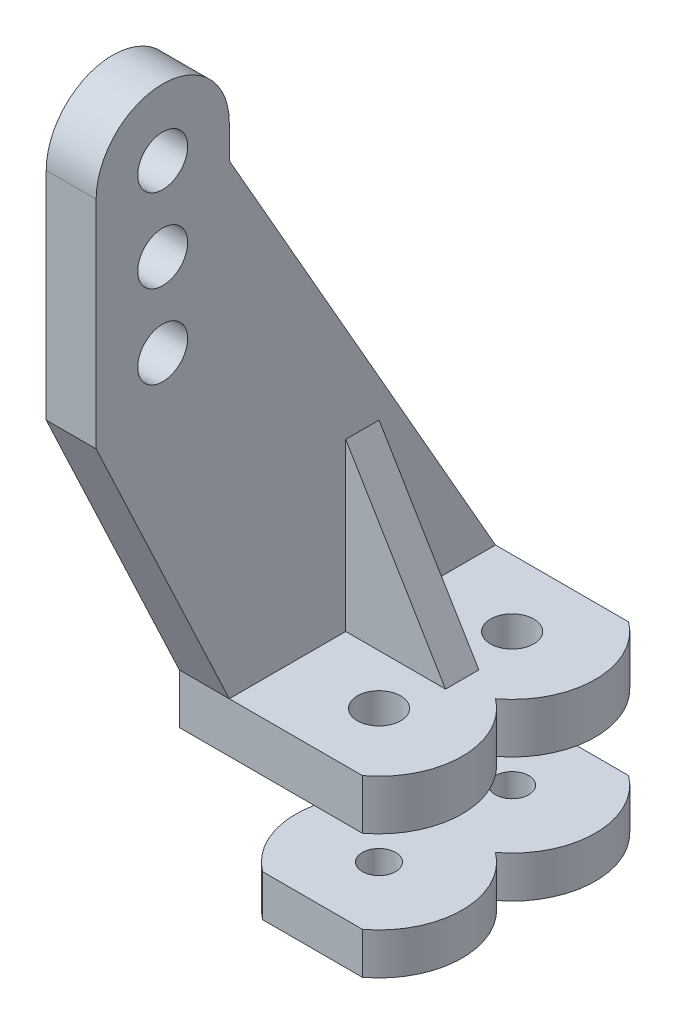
ISO-10303-21;
HEADER;
FILE_DESCRIPTION(('STEP AP214'),'2;1');
FILE_NAME('part.step','',(''),(''),'','','');
FILE_SCHEMA(('AUTOMOTIVE_DESIGN { 1 0 10303 214 1 1 1 1 }'));
ENDSEC;
DATA;
#1=APPLICATION_CONTEXT('core data for automotive mechanical design processes');
#2=APPLICATION_PROTOCOL_DEFINITION('international standard','automotive_design',2000,#1);
#3=PRODUCT_CONTEXT('',#1,'mechanical');
#4=PRODUCT('Part','Part','',(#3));
#5=PRODUCT_RELATED_PRODUCT_CATEGORY('part','',(#4));
#6=PRODUCT_DEFINITION_FORMATION('','',#4);
#7=PRODUCT_DEFINITION_CONTEXT('part definition',#1,'design');
#8=PRODUCT_DEFINITION('design','',#6,#7);
#9=PRODUCT_DEFINITION_SHAPE('','',#8);
#10=(LENGTH_UNIT() NAMED_UNIT(*) SI_UNIT(.MILLI.,.METRE.));
#11=(NAMED_UNIT(*) PLANE_ANGLE_UNIT() SI_UNIT($,.RADIAN.));
#12=(NAMED_UNIT(*) SI_UNIT($,.STERADIAN.) SOLID_ANGLE_UNIT());
#13=UNCERTAINTY_MEASURE_WITH_UNIT(LENGTH_MEASURE(1.E-05),#10,'distance_accuracy_value','');
#14=(GEOMETRIC_REPRESENTATION_CONTEXT(3) GLOBAL_UNCERTAINTY_ASSIGNED_CONTEXT((#13)) GLOBAL_UNIT_ASSIGNED_CONTEXT((#10,
#11,#12)) REPRESENTATION_CONTEXT('',''));
#15=CARTESIAN_POINT('',(0.,0.,0.));
#16=DIRECTION('',(0.,0.,1.));
#17=DIRECTION('',(1.,0.,0.));
#18=AXIS2_PLACEMENT_3D('',#15,#16,#17);
#19=CARTESIAN_POINT('',(6.5,-5.,-8.));
#20=DIRECTION('',(0.,1.,0.));
#21=DIRECTION('',(0.,0.,1.));
#22=AXIS2_PLACEMENT_3D('',#19,#20,#21);
#23=PLANE('',#22);
#24=CARTESIAN_POINT('',(6.5,-5.,-8.));
#25=DIRECTION('',(0.,1.,0.));
#26=DIRECTION('',(0.,0.,1.));
#27=AXIS2_PLACEMENT_3D('',#24,#25,#26);
#28=CIRCLE('',#27,2.);
#29=CARTESIAN_POINT('',(6.5,-5.,-6.));
#30=VERTEX_POINT('',#29);
#31=EDGE_CURVE('E48',#30,#30,#28,.F.);
#32=ORIENTED_EDGE('',*,*,#31,.F.);
#33=EDGE_LOOP('',(#32));
#34=FACE_BOUND('',#33,.T.);
#35=CARTESIAN_POINT('',(6.5,-5.,-8.));
#36=DIRECTION('',(0.,1.,0.));
#37=DIRECTION('',(0.,0.,1.));
#38=AXIS2_PLACEMENT_3D('',#35,#36,#37);
#39=CIRCLE('',#38,5.);
#40=CARTESIAN_POINT('',(3.5,-5.,-12.));
#41=VERTEX_POINT('',#40);
#42=CARTESIAN_POINT('',(3.5,-5.,-3.99999999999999));
#43=VERTEX_POINT('',#42);
#44=EDGE_CURVE('E97',#41,#43,#39,.T.);
#45=ORIENTED_EDGE('',*,*,#44,.F.);
#46=CARTESIAN_POINT('',(6.5,-5.,-16.));
#47=DIRECTION('',(0.,1.,0.));
#48=DIRECTION('',(0.,0.,1.));
#49=AXIS2_PLACEMENT_3D('',#46,#47,#48);
#50=CIRCLE('',#49,5.);
#51=CARTESIAN_POINT('',(3.5,-5.,-20.));
#52=VERTEX_POINT('',#51);
#53=EDGE_CURVE('E102',#52,#41,#50,.T.);
#54=ORIENTED_EDGE('',*,*,#53,.F.);
#55=DIRECTION('',(-1.,0.,0.));
#56=VECTOR('',#55,1.);
#57=CARTESIAN_POINT('',(9.49999999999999,-5.,-20.));
#58=LINE('',#57,#56);
#59=CARTESIAN_POINT('',(9.5,-5.,-20.));
#60=VERTEX_POINT('',#59);
#61=EDGE_CURVE('E138',#60,#52,#58,.T.);
#62=ORIENTED_EDGE('',*,*,#61,.F.);
#63=CARTESIAN_POINT('',(6.5,-5.,-16.));
#64=DIRECTION('',(0.,1.,0.));
#65=DIRECTION('',(0.,0.,1.));
#66=AXIS2_PLACEMENT_3D('',#63,#64,#65);
#67=CIRCLE('',#66,5.);
#68=CARTESIAN_POINT('',(9.5,-5.,-12.));
#69=VERTEX_POINT('',#68);
#70=EDGE_CURVE('E135',#69,#60,#67,.T.);
#71=ORIENTED_EDGE('',*,*,#70,.F.);
#72=CARTESIAN_POINT('',(6.5,-5.,-8.));
#73=DIRECTION('',(0.,1.,0.));
#74=DIRECTION('',(0.,0.,1.));
#75=AXIS2_PLACEMENT_3D('',#72,#73,#74);
#76=CIRCLE('',#75,5.);
#77=CARTESIAN_POINT('',(9.49999999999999,-5.,-3.99999999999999));
#78=VERTEX_POINT('',#77);
#79=EDGE_CURVE('E132',#78,#69,#76,.T.);
#80=ORIENTED_EDGE('',*,*,#79,.F.);
#81=DIRECTION('',(1.,0.,0.));
#82=VECTOR('',#81,1.);
#83=CARTESIAN_POINT('',(9.49999999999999,-5.,-3.99999999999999));
#84=LINE('',#83,#82);
#85=EDGE_CURVE('E130',#43,#78,#84,.T.);
#86=ORIENTED_EDGE('',*,*,#85,.F.);
#87=EDGE_LOOP('',(#45,#54,#62,#71,#80,#86));
#88=FACE_BOUND('',#87,.T.);
#89=CARTESIAN_POINT('',(6.5,-5.,-16.));
#90=DIRECTION('',(0.,1.,0.));
#91=DIRECTION('',(0.,0.,1.));
#92=AXIS2_PLACEMENT_3D('',#89,#90,#91);
#93=CIRCLE('',#92,2.);
#94=CARTESIAN_POINT('',(6.5,-5.,-14.));
#95=VERTEX_POINT('',#94);
#96=EDGE_CURVE('E12',#95,#95,#93,.F.);
#97=ORIENTED_EDGE('',*,*,#96,.F.);
#98=EDGE_LOOP('',(#97));
#99=FACE_BOUND('',#98,.T.);
#100=ADVANCED_FACE('F40',(#34,#88,#99),#23,.F.);
#101=CARTESIAN_POINT('',(6.5,-5.,-8.));
#102=DIRECTION('',(0.,1.,0.));
#103=DIRECTION('',(0.,0.,1.));
#104=AXIS2_PLACEMENT_3D('',#101,#102,#103);
#105=CYLINDRICAL_SURFACE('',#104,5.);
#106=CARTESIAN_POINT('',(6.5,-2.5,-8.));
#107=DIRECTION('',(0.,1.,0.));
#108=DIRECTION('',(0.,0.,1.));
#109=AXIS2_PLACEMENT_3D('',#106,#107,#108);
#110=CIRCLE('',#109,5.);
#111=CARTESIAN_POINT('',(3.5,-2.5,-12.));
#112=VERTEX_POINT('',#111);
#113=CARTESIAN_POINT('',(3.5,-2.5,-3.99999999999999));
#114=VERTEX_POINT('',#113);
#115=EDGE_CURVE('E95',#112,#114,#110,.T.);
#116=ORIENTED_EDGE('',*,*,#115,.F.);
#117=DIRECTION('',(0.,1.,0.));
#118=VECTOR('',#117,1.);
#119=CARTESIAN_POINT('',(3.5,-5.,-12.));
#120=LINE('',#119,#118);
#121=EDGE_CURVE('E55',#41,#112,#120,.T.);
#122=ORIENTED_EDGE('',*,*,#121,.F.);
#123=ORIENTED_EDGE('',*,*,#44,.T.);
#124=DIRECTION('',(0.,1.,0.));
#125=VECTOR('',#124,1.);
#126=CARTESIAN_POINT('',(3.5,-5.,-3.99999999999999));
#127=LINE('',#126,#125);
#128=EDGE_CURVE('E92',#43,#114,#127,.T.);
#129=ORIENTED_EDGE('',*,*,#128,.T.);
#130=EDGE_LOOP('',(#116,#122,#123,#129));
#131=FACE_BOUND('',#130,.T.);
#132=ADVANCED_FACE('F42',(#131),#105,.T.);
#133=CARTESIAN_POINT('',(6.5,-5.,-16.));
#134=DIRECTION('',(0.,1.,0.));
#135=DIRECTION('',(0.,0.,1.));
#136=AXIS2_PLACEMENT_3D('',#133,#134,#135);
#137=CYLINDRICAL_SURFACE('',#136,5.);
#138=CARTESIAN_POINT('',(6.5,-2.5,-16.));
#139=DIRECTION('',(0.,1.,0.));
#140=DIRECTION('',(0.,0.,1.));
#141=AXIS2_PLACEMENT_3D('',#138,#139,#140);
#142=CIRCLE('',#141,5.);
#143=CARTESIAN_POINT('',(3.5,-2.5,-20.));
#144=VERTEX_POINT('',#143);
#145=EDGE_CURVE('E114',#144,#112,#142,.T.);
#146=ORIENTED_EDGE('',*,*,#145,.F.);
#147=DIRECTION('',(0.,1.,0.));
#148=VECTOR('',#147,1.);
#149=CARTESIAN_POINT('',(3.5,-5.,-20.));
#150=LINE('',#149,#148);
#151=EDGE_CURVE('E63',#52,#144,#150,.T.);
#152=ORIENTED_EDGE('',*,*,#151,.F.);
#153=ORIENTED_EDGE('',*,*,#53,.T.);
#154=ORIENTED_EDGE('',*,*,#121,.T.);
#155=EDGE_LOOP('',(#146,#152,#153,#154));
#156=FACE_BOUND('',#155,.T.);
#157=ADVANCED_FACE('F210',(#156),#137,.T.);
#158=CARTESIAN_POINT('',(9.49999999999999,-5.,-20.));
#159=DIRECTION('',(0.,0.,-1.));
#160=DIRECTION('',(-1.,0.,0.));
#161=AXIS2_PLACEMENT_3D('',#158,#159,#160);
#162=PLANE('',#161);
#163=DIRECTION('',(-1.,0.,0.));
#164=VECTOR('',#163,1.);
#165=CARTESIAN_POINT('',(9.49999999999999,-2.5,-20.));
#166=LINE('',#165,#164);
#167=CARTESIAN_POINT('',(9.5,-2.5,-20.));
#168=VERTEX_POINT('',#167);
#169=EDGE_CURVE('E126',#168,#144,#166,.T.);
#170=ORIENTED_EDGE('',*,*,#169,.F.);
#171=DIRECTION('',(0.,1.,0.));
#172=VECTOR('',#171,1.);
#173=CARTESIAN_POINT('',(9.5,-5.,-20.));
#174=LINE('',#173,#172);
#175=EDGE_CURVE('E143',#60,#168,#174,.T.);
#176=ORIENTED_EDGE('',*,*,#175,.F.);
#177=ORIENTED_EDGE('',*,*,#61,.T.);
#178=ORIENTED_EDGE('',*,*,#151,.T.);
#179=EDGE_LOOP('',(#170,#176,#177,#178));
#180=FACE_BOUND('',#179,.T.);
#181=ADVANCED_FACE('F213',(#180),#162,.T.);
#182=CARTESIAN_POINT('',(6.5,-5.,-16.));
#183=DIRECTION('',(0.,1.,0.));
#184=DIRECTION('',(0.,0.,1.));
#185=AXIS2_PLACEMENT_3D('',#182,#183,#184);
#186=CYLINDRICAL_SURFACE('',#185,5.);
#187=CARTESIAN_POINT('',(6.5,-2.5,-16.));
#188=DIRECTION('',(0.,1.,0.));
#189=DIRECTION('',(0.,0.,1.));
#190=AXIS2_PLACEMENT_3D('',#187,#188,#189);
#191=CIRCLE('',#190,5.);
#192=CARTESIAN_POINT('',(9.5,-2.5,-12.));
#193=VERTEX_POINT('',#192);
#194=EDGE_CURVE('E123',#193,#168,#191,.T.);
#195=ORIENTED_EDGE('',*,*,#194,.F.);
#196=DIRECTION('',(0.,1.,0.));
#197=VECTOR('',#196,1.);
#198=CARTESIAN_POINT('',(9.5,-5.,-12.));
#199=LINE('',#198,#197);
#200=EDGE_CURVE('E145',#69,#193,#199,.T.);
#201=ORIENTED_EDGE('',*,*,#200,.F.);
#202=ORIENTED_EDGE('',*,*,#70,.T.);
#203=ORIENTED_EDGE('',*,*,#175,.T.);
#204=EDGE_LOOP('',(#195,#201,#202,#203));
#205=FACE_BOUND('',#204,.T.);
#206=ADVANCED_FACE('F216',(#205),#186,.T.);
#207=CARTESIAN_POINT('',(6.5,-5.,-8.));
#208=DIRECTION('',(0.,1.,0.));
#209=DIRECTION('',(0.,0.,1.));
#210=AXIS2_PLACEMENT_3D('',#207,#208,#209);
#211=CYLINDRICAL_SURFACE('',#210,5.);
#212=CARTESIAN_POINT('',(6.5,-2.5,-8.));
#213=DIRECTION('',(0.,1.,0.));
#214=DIRECTION('',(0.,0.,1.));
#215=AXIS2_PLACEMENT_3D('',#212,#213,#214);
#216=CIRCLE('',#215,5.);
#217=CARTESIAN_POINT('',(9.49999999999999,-2.5,-3.99999999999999));
#218=VERTEX_POINT('',#217);
#219=EDGE_CURVE('E110',#218,#193,#216,.T.);
#220=ORIENTED_EDGE('',*,*,#219,.F.);
#221=DIRECTION('',(0.,1.,0.));
#222=VECTOR('',#221,1.);
#223=CARTESIAN_POINT('',(9.49999999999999,-5.,-3.99999999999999));
#224=LINE('',#223,#222);
#225=EDGE_CURVE('E101',#78,#218,#224,.T.);
#226=ORIENTED_EDGE('',*,*,#225,.F.);
#227=ORIENTED_EDGE('',*,*,#79,.T.);
#228=ORIENTED_EDGE('',*,*,#200,.T.);
#229=EDGE_LOOP('',(#220,#226,#227,#228));
#230=FACE_BOUND('',#229,.T.);
#231=ADVANCED_FACE('F220',(#230),#211,.T.);
#232=CARTESIAN_POINT('',(9.49999999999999,-5.,-3.99999999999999));
#233=DIRECTION('',(0.,0.,1.));
#234=DIRECTION('',(1.,0.,0.));
#235=AXIS2_PLACEMENT_3D('',#232,#233,#234);
#236=PLANE('',#235);
#237=DIRECTION('',(1.,0.,0.));
#238=VECTOR('',#237,1.);
#239=CARTESIAN_POINT('',(9.49999999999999,-2.5,-3.99999999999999));
#240=LINE('',#239,#238);
#241=EDGE_CURVE('E105',#114,#218,#240,.T.);
#242=ORIENTED_EDGE('',*,*,#241,.F.);
#243=ORIENTED_EDGE('',*,*,#128,.F.);
#244=ORIENTED_EDGE('',*,*,#85,.T.);
#245=ORIENTED_EDGE('',*,*,#225,.T.);
#246=EDGE_LOOP('',(#242,#243,#244,#245));
#247=FACE_BOUND('',#246,.T.);
#248=ADVANCED_FACE('F106',(#247),#236,.T.);
#249=CARTESIAN_POINT('',(6.5,-2.5,-8.));
#250=DIRECTION('',(0.,1.,0.));
#251=DIRECTION('',(0.,0.,1.));
#252=AXIS2_PLACEMENT_3D('',#249,#250,#251);
#253=PLANE('',#252);
#254=CARTESIAN_POINT('',(6.5,-2.5,-16.));
#255=DIRECTION('',(0.,1.,0.));
#256=DIRECTION('',(0.,0.,1.));
#257=AXIS2_PLACEMENT_3D('',#254,#255,#256);
#258=CIRCLE('',#257,1.);
#259=CARTESIAN_POINT('',(6.5,-2.5,-15.));
#260=VERTEX_POINT('',#259);
#261=EDGE_CURVE('E118',#260,#260,#258,.T.);
#262=ORIENTED_EDGE('',*,*,#261,.F.);
#263=EDGE_LOOP('',(#262));
#264=FACE_BOUND('',#263,.T.);
#265=CARTESIAN_POINT('',(6.5,-2.5,-8.));
#266=DIRECTION('',(0.,1.,0.));
#267=DIRECTION('',(0.,0.,1.));
#268=AXIS2_PLACEMENT_3D('',#265,#266,#267);
#269=CIRCLE('',#268,1.);
#270=CARTESIAN_POINT('',(6.5,-2.5,-7.));
#271=VERTEX_POINT('',#270);
#272=EDGE_CURVE('E115',#271,#271,#269,.T.);
#273=ORIENTED_EDGE('',*,*,#272,.F.);
#274=EDGE_LOOP('',(#273));
#275=FACE_BOUND('',#274,.T.);
#276=ORIENTED_EDGE('',*,*,#115,.T.);
#277=ORIENTED_EDGE('',*,*,#241,.T.);
#278=ORIENTED_EDGE('',*,*,#219,.T.);
#279=ORIENTED_EDGE('',*,*,#194,.T.);
#280=ORIENTED_EDGE('',*,*,#169,.T.);
#281=ORIENTED_EDGE('',*,*,#145,.T.);
#282=EDGE_LOOP('',(#276,#277,#278,#279,#280,#281));
#283=FACE_BOUND('',#282,.T.);
#284=ADVANCED_FACE('F112',(#264,#275,#283),#253,.T.);
#285=CARTESIAN_POINT('',(6.5,-5.,-8.));
#286=DIRECTION('',(0.,1.,0.));
#287=DIRECTION('',(0.,0.,1.));
#288=AXIS2_PLACEMENT_3D('',#285,#286,#287);
#289=CYLINDRICAL_SURFACE('',#288,1.);
#290=ORIENTED_EDGE('',*,*,#272,.T.);
#291=EDGE_LOOP('',(#290));
#292=FACE_BOUND('',#291,.T.);
#293=CARTESIAN_POINT('',(6.5,-7.5,-8.));
#294=DIRECTION('',(0.,1.,0.));
#295=DIRECTION('',(0.,0.,1.));
#296=AXIS2_PLACEMENT_3D('',#293,#294,#295);
#297=CIRCLE('',#296,0.999999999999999);
#298=CARTESIAN_POINT('',(6.5,-7.5,-7.));
#299=VERTEX_POINT('',#298);
#300=EDGE_CURVE('E172',#299,#299,#297,.T.);
#301=ORIENTED_EDGE('',*,*,#300,.F.);
#302=EDGE_LOOP('',(#301));
#303=FACE_BOUND('',#302,.T.);
#304=ADVANCED_FACE('F187',(#292,#303),#289,.F.);
#305=CARTESIAN_POINT('',(6.5,-5.,-16.));
#306=DIRECTION('',(0.,1.,0.));
#307=DIRECTION('',(0.,0.,1.));
#308=AXIS2_PLACEMENT_3D('',#305,#306,#307);
#309=CYLINDRICAL_SURFACE('',#308,1.);
#310=ORIENTED_EDGE('',*,*,#261,.T.);
#311=EDGE_LOOP('',(#310));
#312=FACE_BOUND('',#311,.T.);
#313=CARTESIAN_POINT('',(6.5,-7.5,-16.));
#314=DIRECTION('',(0.,1.,0.));
#315=DIRECTION('',(0.,0.,1.));
#316=AXIS2_PLACEMENT_3D('',#313,#314,#315);
#317=CIRCLE('',#316,1.);
#318=CARTESIAN_POINT('',(6.5,-7.5,-15.));
#319=VERTEX_POINT('',#318);
#320=EDGE_CURVE('E169',#319,#319,#317,.T.);
#321=ORIENTED_EDGE('',*,*,#320,.F.);
#322=EDGE_LOOP('',(#321));
#323=FACE_BOUND('',#322,.T.);
#324=ADVANCED_FACE('F182',(#312,#323),#309,.F.);
#325=CARTESIAN_POINT('',(6.5,-7.5,-8.));
#326=DIRECTION('',(0.,1.,0.));
#327=DIRECTION('',(0.,0.,1.));
#328=AXIS2_PLACEMENT_3D('',#325,#326,#327);
#329=CONICAL_SURFACE('',#328,1.25,0.291456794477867);
#330=ORIENTED_EDGE('',*,*,#31,.T.);
#331=EDGE_LOOP('',(#330));
#332=FACE_BOUND('',#331,.T.);
#333=CARTESIAN_POINT('',(6.5,-7.5,-8.));
#334=DIRECTION('',(0.,1.,0.));
#335=DIRECTION('',(0.,0.,1.));
#336=AXIS2_PLACEMENT_3D('',#333,#334,#335);
#337=CIRCLE('',#336,1.25);
#338=CARTESIAN_POINT('',(6.5,-7.5,-6.75));
#339=VERTEX_POINT('',#338);
#340=EDGE_CURVE('E177',#339,#339,#337,.T.);
#341=ORIENTED_EDGE('',*,*,#340,.T.);
#342=EDGE_LOOP('',(#341));
#343=FACE_BOUND('',#342,.T.);
#344=ADVANCED_FACE('F150',(#332,#343),#329,.T.);
#345=CARTESIAN_POINT('',(6.5,-7.5,-9.25));
#346=DIRECTION('',(0.,1.,0.));
#347=DIRECTION('',(0.,0.,1.));
#348=AXIS2_PLACEMENT_3D('',#345,#346,#347);
#349=PLANE('',#348);
#350=ORIENTED_EDGE('',*,*,#340,.F.);
#351=EDGE_LOOP('',(#350));
#352=FACE_BOUND('',#351,.T.);
#353=ORIENTED_EDGE('',*,*,#300,.T.);
#354=EDGE_LOOP('',(#353));
#355=FACE_BOUND('',#354,.T.);
#356=ADVANCED_FACE('F196',(#352,#355),#349,.F.);
#357=CARTESIAN_POINT('',(6.5,-7.5,-17.25));
#358=DIRECTION('',(0.,1.,0.));
#359=DIRECTION('',(0.,0.,1.));
#360=AXIS2_PLACEMENT_3D('',#357,#358,#359);
#361=PLANE('',#360);
#362=CARTESIAN_POINT('',(6.5,-7.5,-16.));
#363=DIRECTION('',(0.,1.,0.));
#364=DIRECTION('',(0.,0.,1.));
#365=AXIS2_PLACEMENT_3D('',#362,#363,#364);
#366=CIRCLE('',#365,1.25);
#367=CARTESIAN_POINT('',(6.5,-7.5,-14.75));
#368=VERTEX_POINT('',#367);
#369=EDGE_CURVE('E167',#368,#368,#366,.T.);
#370=ORIENTED_EDGE('',*,*,#369,.F.);
#371=EDGE_LOOP('',(#370));
#372=FACE_BOUND('',#371,.T.);
#373=ORIENTED_EDGE('',*,*,#320,.T.);
#374=EDGE_LOOP('',(#373));
#375=FACE_BOUND('',#374,.T.);
#376=ADVANCED_FACE('F163',(#372,#375),#361,.F.);
#377=CARTESIAN_POINT('',(6.5,-7.5,-16.));
#378=DIRECTION('',(0.,1.,0.));
#379=DIRECTION('',(0.,0.,1.));
#380=AXIS2_PLACEMENT_3D('',#377,#378,#379);
#381=CONICAL_SURFACE('',#380,1.25,0.291456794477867);
#382=ORIENTED_EDGE('',*,*,#96,.T.);
#383=EDGE_LOOP('',(#382));
#384=FACE_BOUND('',#383,.T.);
#385=ORIENTED_EDGE('',*,*,#369,.T.);
#386=EDGE_LOOP('',(#385));
#387=FACE_BOUND('',#386,.T.);
#388=ADVANCED_FACE('F160',(#384,#387),#381,.T.);
#389=CLOSED_SHELL('',(#100,#132,#157,#181,#206,#231,#248,#284,#304,#324,#344,#356,#376,#388));
#390=MANIFOLD_SOLID_BREP('B2',#389);
#391=CARTESIAN_POINT('',(1.5,35.5,0.));
#392=DIRECTION('',(1.,0.,0.));
#393=DIRECTION('',(0.,0.,-1.));
#394=AXIS2_PLACEMENT_3D('',#391,#392,#393);
#395=PLANE('',#394);
#396=CARTESIAN_POINT('',(1.5,30.5,0.));
#397=DIRECTION('',(1.,0.,0.));
#398=DIRECTION('',(0.,0.,-1.));
#399=AXIS2_PLACEMENT_3D('',#396,#397,#398);
#400=CIRCLE('',#399,1.5);
#401=CARTESIAN_POINT('',(1.5,30.5,-1.5));
#402=VERTEX_POINT('',#401);
#403=EDGE_CURVE('E488',#402,#402,#400,.T.);
#404=ORIENTED_EDGE('',*,*,#403,.F.);
#405=EDGE_LOOP('',(#404));
#406=FACE_BOUND('',#405,.T.);
#407=CARTESIAN_POINT('',(1.5,35.5,0.));
#408=DIRECTION('',(1.,0.,0.));
#409=DIRECTION('',(0.,0.,-1.));
#410=AXIS2_PLACEMENT_3D('',#407,#408,#409);
#411=CIRCLE('',#410,1.5);
#412=CARTESIAN_POINT('',(1.5,35.5,-1.5));
#413=VERTEX_POINT('',#412);
#414=EDGE_CURVE('E494',#413,#413,#411,.T.);
#415=ORIENTED_EDGE('',*,*,#414,.F.);
#416=EDGE_LOOP('',(#415));
#417=FACE_BOUND('',#416,.T.);
#418=CARTESIAN_POINT('',(1.5,25.5,0.));
#419=DIRECTION('',(1.,0.,0.));
#420=DIRECTION('',(0.,0.,-1.));
#421=AXIS2_PLACEMENT_3D('',#418,#419,#420);
#422=CIRCLE('',#421,1.5);
#423=CARTESIAN_POINT('',(1.5,25.5,-1.5));
#424=VERTEX_POINT('',#423);
#425=EDGE_CURVE('E482',#424,#424,#422,.T.);
#426=ORIENTED_EDGE('',*,*,#425,.F.);
#427=EDGE_LOOP('',(#426));
#428=FACE_BOUND('',#427,.T.);
#429=DIRECTION('',(0.,0.,-1.));
#430=VECTOR('',#429,1.);
#431=CARTESIAN_POINT('',(1.5,5.5,0.));
#432=LINE('',#431,#430);
#433=CARTESIAN_POINT('',(1.5,5.5,-4.));
#434=VERTEX_POINT('',#433);
#435=CARTESIAN_POINT('',(1.5,5.5,-11.));
#436=VERTEX_POINT('',#435);
#437=EDGE_CURVE('E477',#434,#436,#432,.T.);
#438=ORIENTED_EDGE('',*,*,#437,.T.);
#439=DIRECTION('',(0.,-1.,0.));
#440=VECTOR('',#439,1.);
#441=CARTESIAN_POINT('',(1.5,5.5,-11.));
#442=LINE('',#441,#440);
#443=CARTESIAN_POINT('',(1.5,15.5,-11.));
#444=VERTEX_POINT('',#443);
#445=EDGE_CURVE('E433',#444,#436,#442,.T.);
#446=ORIENTED_EDGE('',*,*,#445,.F.);
#447=DIRECTION('',(0.,0.,-1.));
#448=VECTOR('',#447,1.);
#449=CARTESIAN_POINT('',(1.5,15.5,-11.));
#450=LINE('',#449,#448);
#451=CARTESIAN_POINT('',(1.5,15.5,-13.));
#452=VERTEX_POINT('',#451);
#453=EDGE_CURVE('E422',#444,#452,#450,.T.);
#454=ORIENTED_EDGE('',*,*,#453,.T.);
#455=DIRECTION('',(0.,-1.,0.));
#456=VECTOR('',#455,1.);
#457=CARTESIAN_POINT('',(1.5,5.5,-13.));
#458=LINE('',#457,#456);
#459=CARTESIAN_POINT('',(1.5,5.5,-13.));
#460=VERTEX_POINT('',#459);
#461=EDGE_CURVE('E426',#452,#460,#458,.T.);
#462=ORIENTED_EDGE('',*,*,#461,.T.);
#463=CARTESIAN_POINT('',(1.5,5.5,-20.));
#464=VERTEX_POINT('',#463);
#465=EDGE_CURVE('E346',#460,#464,#432,.T.);
#466=ORIENTED_EDGE('',*,*,#465,.T.);
#467=DIRECTION('',(0.,0.868243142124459,0.496138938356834));
#468=VECTOR('',#467,1.);
#469=CARTESIAN_POINT('',(1.5,5.5,-20.));
#470=LINE('',#469,#468);
#471=CARTESIAN_POINT('',(1.5,33.5,-4.));
#472=VERTEX_POINT('',#471);
#473=EDGE_CURVE('E514',#464,#472,#470,.T.);
#474=ORIENTED_EDGE('',*,*,#473,.T.);
#475=DIRECTION('',(0.,1.,0.));
#476=VECTOR('',#475,1.);
#477=CARTESIAN_POINT('',(1.5,33.5,-4.));
#478=LINE('',#477,#476);
#479=CARTESIAN_POINT('',(1.5,35.5,-4.));
#480=VERTEX_POINT('',#479);
#481=EDGE_CURVE('E516',#472,#480,#478,.T.);
#482=ORIENTED_EDGE('',*,*,#481,.T.);
#483=CARTESIAN_POINT('',(1.5,35.5,0.));
#484=DIRECTION('',(1.,0.,0.));
#485=DIRECTION('',(0.,0.,-1.));
#486=AXIS2_PLACEMENT_3D('',#483,#484,#485);
#487=CIRCLE('',#486,4.);
#488=CARTESIAN_POINT('',(1.5,35.5,4.));
#489=VERTEX_POINT('',#488);
#490=EDGE_CURVE('E518',#480,#489,#487,.T.);
#491=ORIENTED_EDGE('',*,*,#490,.T.);
#492=DIRECTION('',(0.,-1.,0.));
#493=VECTOR('',#492,1.);
#494=CARTESIAN_POINT('',(1.5,35.5,4.));
#495=LINE('',#494,#493);
#496=CARTESIAN_POINT('',(1.5,22.5,4.));
#497=VERTEX_POINT('',#496);
#498=EDGE_CURVE('E520',#489,#497,#495,.T.);
#499=ORIENTED_EDGE('',*,*,#498,.T.);
#500=DIRECTION('',(0.,-0.904818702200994,-0.42579703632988));
#501=VECTOR('',#500,1.);
#502=CARTESIAN_POINT('',(1.5,22.5,4.));
#503=LINE('',#502,#501);
#504=EDGE_CURVE('E522',#497,#434,#503,.T.);
#505=ORIENTED_EDGE('',*,*,#504,.T.);
#506=EDGE_LOOP('',(#438,#446,#454,#462,#466,#474,#482,#491,#499,#505));
#507=FACE_BOUND('',#506,.T.);
#508=ADVANCED_FACE('F323',(#406,#417,#428,#507),#395,.T.);
#509=CARTESIAN_POINT('',(6.5,5.5,-16.));
#510=DIRECTION('',(0.,-1.,0.));
#511=DIRECTION('',(0.,0.,-1.));
#512=AXIS2_PLACEMENT_3D('',#509,#510,#511);
#513=PLANE('',#512);
#514=CARTESIAN_POINT('',(6.5,5.5,-16.));
#515=DIRECTION('',(0.,-1.,0.));
#516=DIRECTION('',(0.,0.,-1.));
#517=AXIS2_PLACEMENT_3D('',#514,#515,#516);
#518=CIRCLE('',#517,1.3);
#519=CARTESIAN_POINT('',(6.5,5.5,-17.3));
#520=VERTEX_POINT('',#519);
#521=EDGE_CURVE('E449',#520,#520,#518,.T.);
#522=ORIENTED_EDGE('',*,*,#521,.T.);
#523=EDGE_LOOP('',(#522));
#524=FACE_BOUND('',#523,.T.);
#525=CARTESIAN_POINT('',(6.5,5.5,-8.));
#526=DIRECTION('',(0.,-1.,0.));
#527=DIRECTION('',(0.,0.,-1.));
#528=AXIS2_PLACEMENT_3D('',#525,#526,#527);
#529=CIRCLE('',#528,1.3);
#530=CARTESIAN_POINT('',(6.5,5.5,-9.3));
#531=VERTEX_POINT('',#530);
#532=EDGE_CURVE('E443',#531,#531,#529,.T.);
#533=ORIENTED_EDGE('',*,*,#532,.T.);
#534=EDGE_LOOP('',(#533));
#535=FACE_BOUND('',#534,.T.);
#536=DIRECTION('',(1.,0.,0.));
#537=VECTOR('',#536,1.);
#538=CARTESIAN_POINT('',(7.5,5.5,-11.));
#539=LINE('',#538,#537);
#540=CARTESIAN_POINT('',(7.5,5.5,-11.));
#541=VERTEX_POINT('',#540);
#542=EDGE_CURVE('E430',#436,#541,#539,.T.);
#543=ORIENTED_EDGE('',*,*,#542,.F.);
#544=ORIENTED_EDGE('',*,*,#437,.F.);
#545=DIRECTION('',(-1.,0.,0.));
#546=VECTOR('',#545,1.);
#547=CARTESIAN_POINT('',(-1.5,5.5,-4.));
#548=LINE('',#547,#546);
#549=CARTESIAN_POINT('',(9.49999999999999,5.5,-3.99999999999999));
#550=VERTEX_POINT('',#549);
#551=EDGE_CURVE('E466',#550,#434,#548,.T.);
#552=ORIENTED_EDGE('',*,*,#551,.F.);
#553=CARTESIAN_POINT('',(6.5,5.5,-8.));
#554=DIRECTION('',(0.,-1.,0.));
#555=DIRECTION('',(0.,0.,-1.));
#556=AXIS2_PLACEMENT_3D('',#553,#554,#555);
#557=CIRCLE('',#556,5.);
#558=CARTESIAN_POINT('',(9.5,5.5,-12.));
#559=VERTEX_POINT('',#558);
#560=EDGE_CURVE('E463',#559,#550,#557,.T.);
#561=ORIENTED_EDGE('',*,*,#560,.F.);
#562=CARTESIAN_POINT('',(6.5,5.5,-16.));
#563=DIRECTION('',(0.,-1.,0.));
#564=DIRECTION('',(0.,0.,-1.));
#565=AXIS2_PLACEMENT_3D('',#562,#563,#564);
#566=CIRCLE('',#565,5.);
#567=CARTESIAN_POINT('',(9.49999999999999,5.5,-20.));
#568=VERTEX_POINT('',#567);
#569=EDGE_CURVE('E460',#568,#559,#566,.T.);
#570=ORIENTED_EDGE('',*,*,#569,.F.);
#571=DIRECTION('',(1.,0.,0.));
#572=VECTOR('',#571,1.);
#573=CARTESIAN_POINT('',(-1.5,5.5,-20.));
#574=LINE('',#573,#572);
#575=EDGE_CURVE('E458',#464,#568,#574,.T.);
#576=ORIENTED_EDGE('',*,*,#575,.F.);
#577=ORIENTED_EDGE('',*,*,#465,.F.);
#578=DIRECTION('',(1.,0.,0.));
#579=VECTOR('',#578,1.);
#580=CARTESIAN_POINT('',(7.5,5.5,-13.));
#581=LINE('',#580,#579);
#582=CARTESIAN_POINT('',(7.5,5.5,-13.));
#583=VERTEX_POINT('',#582);
#584=EDGE_CURVE('E427',#460,#583,#581,.T.);
#585=ORIENTED_EDGE('',*,*,#584,.T.);
#586=DIRECTION('',(0.,0.,-1.));
#587=VECTOR('',#586,1.);
#588=CARTESIAN_POINT('',(7.5,5.5,-11.));
#589=LINE('',#588,#587);
#590=EDGE_CURVE('E338',#541,#583,#589,.T.);
#591=ORIENTED_EDGE('',*,*,#590,.F.);
#592=EDGE_LOOP('',(#543,#544,#552,#561,#570,#576,#577,#585,#591));
#593=FACE_BOUND('',#592,.T.);
#594=ADVANCED_FACE('F588',(#524,#535,#593),#513,.F.);
#595=CARTESIAN_POINT('',(-1.5,35.5,0.));
#596=DIRECTION('',(1.,0.,0.));
#597=DIRECTION('',(0.,0.,-1.));
#598=AXIS2_PLACEMENT_3D('',#595,#596,#597);
#599=PLANE('',#598);
#600=DIRECTION('',(0.,-1.,0.));
#601=VECTOR('',#600,1.);
#602=CARTESIAN_POINT('',(-1.5,5.5,-4.));
#603=LINE('',#602,#601);
#604=CARTESIAN_POINT('',(-1.5,5.5,-4.));
#605=VERTEX_POINT('',#604);
#606=CARTESIAN_POINT('',(-1.5,2.5,-4.));
#607=VERTEX_POINT('',#606);
#608=EDGE_CURVE('E508',#605,#607,#603,.T.);
#609=ORIENTED_EDGE('',*,*,#608,.F.);
#610=DIRECTION('',(0.,-0.904818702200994,-0.42579703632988));
#611=VECTOR('',#610,1.);
#612=CARTESIAN_POINT('',(-1.5,22.5,4.));
#613=LINE('',#612,#611);
#614=CARTESIAN_POINT('',(-1.5,22.5,4.));
#615=VERTEX_POINT('',#614);
#616=EDGE_CURVE('E506',#615,#605,#613,.T.);
#617=ORIENTED_EDGE('',*,*,#616,.F.);
#618=DIRECTION('',(0.,-1.,0.));
#619=VECTOR('',#618,1.);
#620=CARTESIAN_POINT('',(-1.5,35.5,4.));
#621=LINE('',#620,#619);
#622=CARTESIAN_POINT('',(-1.5,35.5,4.));
#623=VERTEX_POINT('',#622);
#624=EDGE_CURVE('E504',#623,#615,#621,.T.);
#625=ORIENTED_EDGE('',*,*,#624,.F.);
#626=CARTESIAN_POINT('',(-1.5,35.5,0.));
#627=DIRECTION('',(1.,0.,0.));
#628=DIRECTION('',(0.,0.,-1.));
#629=AXIS2_PLACEMENT_3D('',#626,#627,#628);
#630=CIRCLE('',#629,4.);
#631=CARTESIAN_POINT('',(-1.5,35.5,-4.));
#632=VERTEX_POINT('',#631);
#633=EDGE_CURVE('E502',#632,#623,#630,.T.);
#634=ORIENTED_EDGE('',*,*,#633,.F.);
#635=DIRECTION('',(0.,1.,0.));
#636=VECTOR('',#635,1.);
#637=CARTESIAN_POINT('',(-1.5,33.5,-4.));
#638=LINE('',#637,#636);
#639=CARTESIAN_POINT('',(-1.5,33.5,-4.));
#640=VERTEX_POINT('',#639);
#641=EDGE_CURVE('E500',#640,#632,#638,.T.);
#642=ORIENTED_EDGE('',*,*,#641,.F.);
#643=DIRECTION('',(0.,0.868243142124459,0.496138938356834));
#644=VECTOR('',#643,1.);
#645=CARTESIAN_POINT('',(-1.5,5.5,-20.));
#646=LINE('',#645,#644);
#647=CARTESIAN_POINT('',(-1.5,5.5,-20.));
#648=VERTEX_POINT('',#647);
#649=EDGE_CURVE('E497',#648,#640,#646,.T.);
#650=ORIENTED_EDGE('',*,*,#649,.F.);
#651=DIRECTION('',(0.,1.,0.));
#652=VECTOR('',#651,1.);
#653=CARTESIAN_POINT('',(-1.5,2.5,-20.));
#654=LINE('',#653,#652);
#655=CARTESIAN_POINT('',(-1.5,2.5,-20.));
#656=VERTEX_POINT('',#655);
#657=EDGE_CURVE('E512',#656,#648,#654,.T.);
#658=ORIENTED_EDGE('',*,*,#657,.F.);
#659=DIRECTION('',(0.,0.,-1.));
#660=VECTOR('',#659,1.);
#661=CARTESIAN_POINT('',(-1.5,2.5,-4.));
#662=LINE('',#661,#660);
#663=EDGE_CURVE('E510',#607,#656,#662,.T.);
#664=ORIENTED_EDGE('',*,*,#663,.F.);
#665=EDGE_LOOP('',(#609,#617,#625,#634,#642,#650,#658,#664));
#666=FACE_BOUND('',#665,.T.);
#667=CARTESIAN_POINT('',(-1.5,25.5,0.));
#668=DIRECTION('',(1.,0.,0.));
#669=DIRECTION('',(0.,0.,-1.));
#670=AXIS2_PLACEMENT_3D('',#667,#668,#669);
#671=CIRCLE('',#670,1.5);
#672=CARTESIAN_POINT('',(-1.5,25.5,-1.5));
#673=VERTEX_POINT('',#672);
#674=EDGE_CURVE('E479',#673,#673,#671,.T.);
#675=ORIENTED_EDGE('',*,*,#674,.T.);
#676=EDGE_LOOP('',(#675));
#677=FACE_BOUND('',#676,.T.);
#678=CARTESIAN_POINT('',(-1.5,35.5,0.));
#679=DIRECTION('',(1.,0.,0.));
#680=DIRECTION('',(0.,0.,-1.));
#681=AXIS2_PLACEMENT_3D('',#678,#679,#680);
#682=CIRCLE('',#681,1.5);
#683=CARTESIAN_POINT('',(-1.5,35.5,-1.5));
#684=VERTEX_POINT('',#683);
#685=EDGE_CURVE('E491',#684,#684,#682,.T.);
#686=ORIENTED_EDGE('',*,*,#685,.T.);
#687=EDGE_LOOP('',(#686));
#688=FACE_BOUND('',#687,.T.);
#689=CARTESIAN_POINT('',(-1.5,30.5,0.));
#690=DIRECTION('',(1.,0.,0.));
#691=DIRECTION('',(0.,0.,-1.));
#692=AXIS2_PLACEMENT_3D('',#689,#690,#691);
#693=CIRCLE('',#692,1.5);
#694=CARTESIAN_POINT('',(-1.5,30.5,-1.5));
#695=VERTEX_POINT('',#694);
#696=EDGE_CURVE('E485',#695,#695,#693,.T.);
#697=ORIENTED_EDGE('',*,*,#696,.T.);
#698=EDGE_LOOP('',(#697));
#699=FACE_BOUND('',#698,.T.);
#700=ADVANCED_FACE('F552',(#666,#677,#688,#699),#599,.F.);
#701=CARTESIAN_POINT('',(1.5,5.5,-20.));
#702=DIRECTION('',(0.,-0.496138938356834,0.868243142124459));
#703=DIRECTION('',(0.,-0.868243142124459,-0.496138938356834));
#704=AXIS2_PLACEMENT_3D('',#701,#702,#703);
#705=PLANE('',#704);
#706=ORIENTED_EDGE('',*,*,#649,.T.);
#707=DIRECTION('',(-1.,0.,0.));
#708=VECTOR('',#707,1.);
#709=CARTESIAN_POINT('',(1.5,33.5,-4.));
#710=LINE('',#709,#708);
#711=EDGE_CURVE('E38',#472,#640,#710,.T.);
#712=ORIENTED_EDGE('',*,*,#711,.F.);
#713=ORIENTED_EDGE('',*,*,#473,.F.);
#714=DIRECTION('',(-1.,0.,0.));
#715=VECTOR('',#714,1.);
#716=CARTESIAN_POINT('',(1.5,5.5,-20.));
#717=LINE('',#716,#715);
#718=EDGE_CURVE('E524',#464,#648,#717,.T.);
#719=ORIENTED_EDGE('',*,*,#718,.T.);
#720=EDGE_LOOP('',(#706,#712,#713,#719));
#721=FACE_BOUND('',#720,.T.);
#722=ADVANCED_FACE('F325',(#721),#705,.F.);
#723=CARTESIAN_POINT('',(1.5,33.5,-4.));
#724=DIRECTION('',(0.,0.,1.));
#725=DIRECTION('',(0.,-1.,0.));
#726=AXIS2_PLACEMENT_3D('',#723,#724,#725);
#727=PLANE('',#726);
#728=ORIENTED_EDGE('',*,*,#641,.T.);
#729=DIRECTION('',(-1.,0.,0.));
#730=VECTOR('',#729,1.);
#731=CARTESIAN_POINT('',(1.5,35.5,-4.));
#732=LINE('',#731,#730);
#733=EDGE_CURVE('E331',#480,#632,#732,.T.);
#734=ORIENTED_EDGE('',*,*,#733,.F.);
#735=ORIENTED_EDGE('',*,*,#481,.F.);
#736=ORIENTED_EDGE('',*,*,#711,.T.);
#737=EDGE_LOOP('',(#728,#734,#735,#736));
#738=FACE_BOUND('',#737,.T.);
#739=ADVANCED_FACE('F567',(#738),#727,.F.);
#740=CARTESIAN_POINT('',(1.5,35.5,0.));
#741=DIRECTION('',(-1.,0.,0.));
#742=DIRECTION('',(0.,0.,1.));
#743=AXIS2_PLACEMENT_3D('',#740,#741,#742);
#744=CYLINDRICAL_SURFACE('',#743,4.);
#745=ORIENTED_EDGE('',*,*,#633,.T.);
#746=DIRECTION('',(-1.,0.,0.));
#747=VECTOR('',#746,1.);
#748=CARTESIAN_POINT('',(1.5,35.5,4.));
#749=LINE('',#748,#747);
#750=EDGE_CURVE('E539',#489,#623,#749,.T.);
#751=ORIENTED_EDGE('',*,*,#750,.F.);
#752=ORIENTED_EDGE('',*,*,#490,.F.);
#753=ORIENTED_EDGE('',*,*,#733,.T.);
#754=EDGE_LOOP('',(#745,#751,#752,#753));
#755=FACE_BOUND('',#754,.T.);
#756=ADVANCED_FACE('F546',(#755),#744,.T.);
#757=CARTESIAN_POINT('',(1.5,35.5,4.));
#758=DIRECTION('',(0.,0.,-1.));
#759=DIRECTION('',(0.,1.,0.));
#760=AXIS2_PLACEMENT_3D('',#757,#758,#759);
#761=PLANE('',#760);
#762=ORIENTED_EDGE('',*,*,#624,.T.);
#763=DIRECTION('',(-1.,0.,0.));
#764=VECTOR('',#763,1.);
#765=CARTESIAN_POINT('',(1.5,22.5,4.));
#766=LINE('',#765,#764);
#767=EDGE_CURVE('E536',#497,#615,#766,.T.);
#768=ORIENTED_EDGE('',*,*,#767,.F.);
#769=ORIENTED_EDGE('',*,*,#498,.F.);
#770=ORIENTED_EDGE('',*,*,#750,.T.);
#771=EDGE_LOOP('',(#762,#768,#769,#770));
#772=FACE_BOUND('',#771,.T.);
#773=ADVANCED_FACE('F558',(#772),#761,.F.);
#774=CARTESIAN_POINT('',(1.5,22.5,4.));
#775=DIRECTION('',(0.,0.42579703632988,-0.904818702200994));
#776=DIRECTION('',(0.,0.904818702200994,0.42579703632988));
#777=AXIS2_PLACEMENT_3D('',#774,#775,#776);
#778=PLANE('',#777);
#779=ORIENTED_EDGE('',*,*,#616,.T.);
#780=DIRECTION('',(-1.,0.,0.));
#781=VECTOR('',#780,1.);
#782=CARTESIAN_POINT('',(1.5,5.5,-4.));
#783=LINE('',#782,#781);
#784=EDGE_CURVE('E533',#434,#605,#783,.T.);
#785=ORIENTED_EDGE('',*,*,#784,.F.);
#786=ORIENTED_EDGE('',*,*,#504,.F.);
#787=ORIENTED_EDGE('',*,*,#767,.T.);
#788=EDGE_LOOP('',(#779,#785,#786,#787));
#789=FACE_BOUND('',#788,.T.);
#790=ADVANCED_FACE('F562',(#789),#778,.F.);
#791=CARTESIAN_POINT('',(1.5,5.5,-4.));
#792=DIRECTION('',(0.,0.,-1.));
#793=DIRECTION('',(-1.,0.,0.));
#794=AXIS2_PLACEMENT_3D('',#791,#792,#793);
#795=PLANE('',#794);
#796=ORIENTED_EDGE('',*,*,#608,.T.);
#797=DIRECTION('',(-1.,0.,0.));
#798=VECTOR('',#797,1.);
#799=CARTESIAN_POINT('',(1.5,2.5,-4.));
#800=LINE('',#799,#798);
#801=CARTESIAN_POINT('',(9.49999999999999,2.5,-3.99999999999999));
#802=VERTEX_POINT('',#801);
#803=EDGE_CURVE('E530',#802,#607,#800,.T.);
#804=ORIENTED_EDGE('',*,*,#803,.F.);
#805=DIRECTION('',(0.,-1.,0.));
#806=VECTOR('',#805,1.);
#807=CARTESIAN_POINT('',(9.49999999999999,5.5,-3.99999999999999));
#808=LINE('',#807,#806);
#809=EDGE_CURVE('E470',#550,#802,#808,.T.);
#810=ORIENTED_EDGE('',*,*,#809,.F.);
#811=ORIENTED_EDGE('',*,*,#551,.T.);
#812=ORIENTED_EDGE('',*,*,#784,.T.);
#813=EDGE_LOOP('',(#796,#804,#810,#811,#812));
#814=FACE_BOUND('',#813,.T.);
#815=ADVANCED_FACE('F580',(#814),#795,.F.);
#816=CARTESIAN_POINT('',(1.5,2.5,-4.));
#817=DIRECTION('',(0.,1.,0.));
#818=DIRECTION('',(0.,0.,1.));
#819=AXIS2_PLACEMENT_3D('',#816,#817,#818);
#820=PLANE('',#819);
#821=ORIENTED_EDGE('',*,*,#663,.T.);
#822=DIRECTION('',(-1.,0.,0.));
#823=VECTOR('',#822,1.);
#824=CARTESIAN_POINT('',(1.5,2.5,-20.));
#825=LINE('',#824,#823);
#826=CARTESIAN_POINT('',(9.49999999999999,2.5,-20.));
#827=VERTEX_POINT('',#826);
#828=EDGE_CURVE('E527',#827,#656,#825,.T.);
#829=ORIENTED_EDGE('',*,*,#828,.F.);
#830=CARTESIAN_POINT('',(6.5,2.5,-16.));
#831=DIRECTION('',(0.,-1.,0.));
#832=DIRECTION('',(0.,0.,-1.));
#833=AXIS2_PLACEMENT_3D('',#830,#831,#832);
#834=CIRCLE('',#833,5.);
#835=CARTESIAN_POINT('',(9.5,2.5,-12.));
#836=VERTEX_POINT('',#835);
#837=EDGE_CURVE('E452',#827,#836,#834,.T.);
#838=ORIENTED_EDGE('',*,*,#837,.T.);
#839=CARTESIAN_POINT('',(6.5,2.5,-8.));
#840=DIRECTION('',(0.,-1.,0.));
#841=DIRECTION('',(0.,0.,-1.));
#842=AXIS2_PLACEMENT_3D('',#839,#840,#841);
#843=CIRCLE('',#842,5.);
#844=EDGE_CURVE('E455',#836,#802,#843,.T.);
#845=ORIENTED_EDGE('',*,*,#844,.T.);
#846=ORIENTED_EDGE('',*,*,#803,.T.);
#847=EDGE_LOOP('',(#821,#829,#838,#845,#846));
#848=FACE_BOUND('',#847,.T.);
#849=CARTESIAN_POINT('',(6.5,2.5,-8.));
#850=DIRECTION('',(0.,-1.,0.));
#851=DIRECTION('',(0.,0.,-1.));
#852=AXIS2_PLACEMENT_3D('',#849,#850,#851);
#853=CIRCLE('',#852,1.3);
#854=CARTESIAN_POINT('',(6.5,2.5,-9.3));
#855=VERTEX_POINT('',#854);
#856=EDGE_CURVE('E435',#855,#855,#853,.T.);
#857=ORIENTED_EDGE('',*,*,#856,.F.);
#858=EDGE_LOOP('',(#857));
#859=FACE_BOUND('',#858,.T.);
#860=CARTESIAN_POINT('',(6.5,2.5,-16.));
#861=DIRECTION('',(0.,-1.,0.));
#862=DIRECTION('',(0.,0.,-1.));
#863=AXIS2_PLACEMENT_3D('',#860,#861,#862);
#864=CIRCLE('',#863,1.3);
#865=CARTESIAN_POINT('',(6.5,2.5,-17.3));
#866=VERTEX_POINT('',#865);
#867=EDGE_CURVE('E446',#866,#866,#864,.T.);
#868=ORIENTED_EDGE('',*,*,#867,.F.);
#869=EDGE_LOOP('',(#868));
#870=FACE_BOUND('',#869,.T.);
#871=ADVANCED_FACE('F576',(#848,#859,#870),#820,.F.);
#872=CARTESIAN_POINT('',(1.5,2.5,-20.));
#873=DIRECTION('',(0.,0.,1.));
#874=DIRECTION('',(1.,0.,0.));
#875=AXIS2_PLACEMENT_3D('',#872,#873,#874);
#876=PLANE('',#875);
#877=ORIENTED_EDGE('',*,*,#657,.T.);
#878=ORIENTED_EDGE('',*,*,#718,.F.);
#879=ORIENTED_EDGE('',*,*,#575,.T.);
#880=DIRECTION('',(0.,-1.,0.));
#881=VECTOR('',#880,1.);
#882=CARTESIAN_POINT('',(9.49999999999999,5.5,-20.));
#883=LINE('',#882,#881);
#884=EDGE_CURVE('E469',#568,#827,#883,.T.);
#885=ORIENTED_EDGE('',*,*,#884,.T.);
#886=ORIENTED_EDGE('',*,*,#828,.T.);
#887=EDGE_LOOP('',(#877,#878,#879,#885,#886));
#888=FACE_BOUND('',#887,.T.);
#889=ADVANCED_FACE('F572',(#888),#876,.F.);
#890=CARTESIAN_POINT('',(1.5,35.5,0.));
#891=DIRECTION('',(-1.,0.,0.));
#892=DIRECTION('',(0.,0.,1.));
#893=AXIS2_PLACEMENT_3D('',#890,#891,#892);
#894=CYLINDRICAL_SURFACE('',#893,1.5);
#895=ORIENTED_EDGE('',*,*,#414,.T.);
#896=EDGE_LOOP('',(#895));
#897=FACE_BOUND('',#896,.T.);
#898=ORIENTED_EDGE('',*,*,#685,.F.);
#899=EDGE_LOOP('',(#898));
#900=FACE_BOUND('',#899,.T.);
#901=ADVANCED_FACE('F624',(#897,#900),#894,.F.);
#902=CARTESIAN_POINT('',(1.5,30.5,0.));
#903=DIRECTION('',(-1.,0.,0.));
#904=DIRECTION('',(0.,0.,1.));
#905=AXIS2_PLACEMENT_3D('',#902,#903,#904);
#906=CYLINDRICAL_SURFACE('',#905,1.5);
#907=ORIENTED_EDGE('',*,*,#403,.T.);
#908=EDGE_LOOP('',(#907));
#909=FACE_BOUND('',#908,.T.);
#910=ORIENTED_EDGE('',*,*,#696,.F.);
#911=EDGE_LOOP('',(#910));
#912=FACE_BOUND('',#911,.T.);
#913=ADVANCED_FACE('F764',(#909,#912),#906,.F.);
#914=CARTESIAN_POINT('',(1.5,25.5,0.));
#915=DIRECTION('',(-1.,0.,0.));
#916=DIRECTION('',(0.,0.,1.));
#917=AXIS2_PLACEMENT_3D('',#914,#915,#916);
#918=CYLINDRICAL_SURFACE('',#917,1.5);
#919=ORIENTED_EDGE('',*,*,#425,.T.);
#920=EDGE_LOOP('',(#919));
#921=FACE_BOUND('',#920,.T.);
#922=ORIENTED_EDGE('',*,*,#674,.F.);
#923=EDGE_LOOP('',(#922));
#924=FACE_BOUND('',#923,.T.);
#925=ADVANCED_FACE('F606',(#921,#924),#918,.F.);
#926=CARTESIAN_POINT('',(6.5,5.5,-8.));
#927=DIRECTION('',(0.,-1.,0.));
#928=DIRECTION('',(0.,0.,-1.));
#929=AXIS2_PLACEMENT_3D('',#926,#927,#928);
#930=CYLINDRICAL_SURFACE('',#929,5.);
#931=ORIENTED_EDGE('',*,*,#844,.F.);
#932=DIRECTION('',(0.,-1.,0.));
#933=VECTOR('',#932,1.);
#934=CARTESIAN_POINT('',(9.5,5.5,-12.));
#935=LINE('',#934,#933);
#936=EDGE_CURVE('E473',#559,#836,#935,.T.);
#937=ORIENTED_EDGE('',*,*,#936,.F.);
#938=ORIENTED_EDGE('',*,*,#560,.T.);
#939=ORIENTED_EDGE('',*,*,#809,.T.);
#940=EDGE_LOOP('',(#931,#937,#938,#939));
#941=FACE_BOUND('',#940,.T.);
#942=ADVANCED_FACE('F582',(#941),#930,.T.);
#943=CARTESIAN_POINT('',(6.5,5.5,-16.));
#944=DIRECTION('',(0.,-1.,0.));
#945=DIRECTION('',(0.,0.,-1.));
#946=AXIS2_PLACEMENT_3D('',#943,#944,#945);
#947=CYLINDRICAL_SURFACE('',#946,5.);
#948=ORIENTED_EDGE('',*,*,#837,.F.);
#949=ORIENTED_EDGE('',*,*,#884,.F.);
#950=ORIENTED_EDGE('',*,*,#569,.T.);
#951=ORIENTED_EDGE('',*,*,#936,.T.);
#952=EDGE_LOOP('',(#948,#949,#950,#951));
#953=FACE_BOUND('',#952,.T.);
#954=ADVANCED_FACE('F595',(#953),#947,.T.);
#955=CARTESIAN_POINT('',(6.5,5.5,-16.));
#956=DIRECTION('',(0.,-1.,0.));
#957=DIRECTION('',(0.,0.,-1.));
#958=AXIS2_PLACEMENT_3D('',#955,#956,#957);
#959=CYLINDRICAL_SURFACE('',#958,1.3);
#960=ORIENTED_EDGE('',*,*,#521,.F.);
#961=EDGE_LOOP('',(#960));
#962=FACE_BOUND('',#961,.T.);
#963=ORIENTED_EDGE('',*,*,#867,.T.);
#964=EDGE_LOOP('',(#963));
#965=FACE_BOUND('',#964,.T.);
#966=ADVANCED_FACE('F597',(#962,#965),#959,.F.);
#967=CARTESIAN_POINT('',(6.5,5.5,-8.));
#968=DIRECTION('',(0.,-1.,0.));
#969=DIRECTION('',(0.,0.,-1.));
#970=AXIS2_PLACEMENT_3D('',#967,#968,#969);
#971=CYLINDRICAL_SURFACE('',#970,1.3);
#972=ORIENTED_EDGE('',*,*,#532,.F.);
#973=EDGE_LOOP('',(#972));
#974=FACE_BOUND('',#973,.T.);
#975=ORIENTED_EDGE('',*,*,#856,.T.);
#976=EDGE_LOOP('',(#975));
#977=FACE_BOUND('',#976,.T.);
#978=ADVANCED_FACE('F603',(#974,#977),#971,.F.);
#979=CARTESIAN_POINT('',(1.5,15.5,-11.));
#980=DIRECTION('',(-0.857492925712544,-0.514495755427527,0.));
#981=DIRECTION('',(0.514495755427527,-0.857492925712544,0.));
#982=AXIS2_PLACEMENT_3D('',#979,#980,#981);
#983=PLANE('',#982);
#984=DIRECTION('',(-0.514495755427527,0.857492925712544,0.));
#985=VECTOR('',#984,1.);
#986=CARTESIAN_POINT('',(1.5,15.5,-13.));
#987=LINE('',#986,#985);
#988=EDGE_CURVE('E418',#583,#452,#987,.T.);
#989=ORIENTED_EDGE('',*,*,#988,.T.);
#990=ORIENTED_EDGE('',*,*,#453,.F.);
#991=DIRECTION('',(-0.514495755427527,0.857492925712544,0.));
#992=VECTOR('',#991,1.);
#993=CARTESIAN_POINT('',(1.5,15.5,-11.));
#994=LINE('',#993,#992);
#995=EDGE_CURVE('E437',#541,#444,#994,.T.);
#996=ORIENTED_EDGE('',*,*,#995,.F.);
#997=ORIENTED_EDGE('',*,*,#590,.T.);
#998=EDGE_LOOP('',(#989,#990,#996,#997));
#999=FACE_BOUND('',#998,.T.);
#1000=ADVANCED_FACE('F420',(#999),#983,.F.);
#1001=CARTESIAN_POINT('',(1.5,5.5,-11.));
#1002=DIRECTION('',(0.,0.,-1.));
#1003=DIRECTION('',(-1.,0.,0.));
#1004=AXIS2_PLACEMENT_3D('',#1001,#1002,#1003);
#1005=PLANE('',#1004);
#1006=ORIENTED_EDGE('',*,*,#542,.T.);
#1007=ORIENTED_EDGE('',*,*,#995,.T.);
#1008=ORIENTED_EDGE('',*,*,#445,.T.);
#1009=EDGE_LOOP('',(#1006,#1007,#1008));
#1010=FACE_BOUND('',#1009,.T.);
#1011=ADVANCED_FACE('F661',(#1010),#1005,.F.);
#1012=CARTESIAN_POINT('',(1.5,5.5,-13.));
#1013=DIRECTION('',(0.,0.,-1.));
#1014=DIRECTION('',(-1.,0.,0.));
#1015=AXIS2_PLACEMENT_3D('',#1012,#1013,#1014);
#1016=PLANE('',#1015);
#1017=ORIENTED_EDGE('',*,*,#584,.F.);
#1018=ORIENTED_EDGE('',*,*,#461,.F.);
#1019=ORIENTED_EDGE('',*,*,#988,.F.);
#1020=EDGE_LOOP('',(#1017,#1018,#1019));
#1021=FACE_BOUND('',#1020,.T.);
#1022=ADVANCED_FACE('F429',(#1021),#1016,.T.);
#1023=CLOSED_SHELL('',(#508,#594,#700,#722,#739,#756,#773,#790,#815,#871,#889,#901,#913,#925,
#942,#954,#966,#978,#1000,#1011,#1022));
#1024=MANIFOLD_SOLID_BREP('B6',#1023);
#1025=ADVANCED_BREP_SHAPE_REPRESENTATION('',(#18,#390,#1024),#14);
#1026=SHAPE_DEFINITION_REPRESENTATION(#9,#1025);
ENDSEC;
END-ISO-10303-21;
